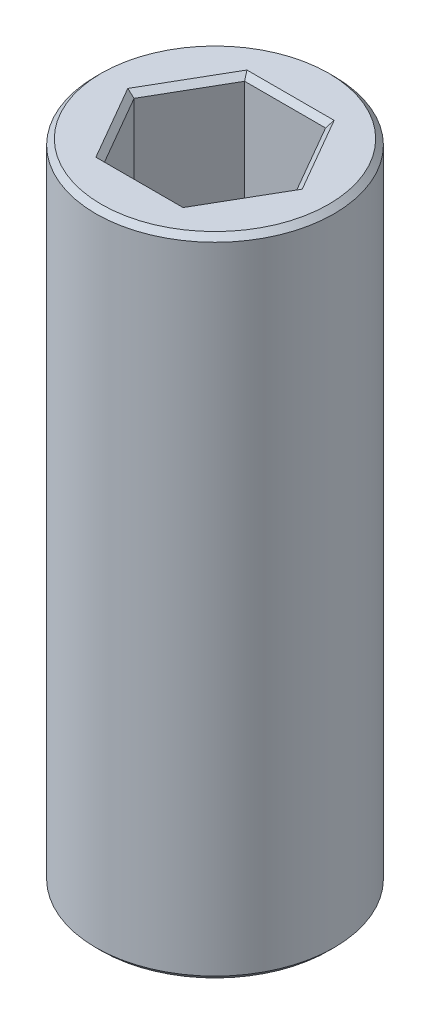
from build123d import *

# Parameters (mm, degrees)
SKETCH1_R           = 11.1125
BOSS_EXTRUDE1_DEPTH = 60.325
CHAMFER1_SIZE       = 0.508


with BuildPart() as part:
    # Sketch1 → Boss-Extrude1 (new body)
    with BuildSketch(Plane(origin=(0, 0, 0), x_dir=(1, 0, 0), z_dir=(0, 1, 0))):
        with Locations(Location((0, 0, 0), (0, 0, 90))):
            Circle(SKETCH1_R)
        Polygon((7.552318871, 0), (3.776159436, 6.5405), (-3.776159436, 6.5405), (-7.552318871, 0), (-3.776159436, -6.5405), (3.776159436, -6.5405), align=None, mode=Mode.SUBTRACT)
    extrude(amount=BOSS_EXTRUDE1_DEPTH)

    # Chamfer1
    chamfer1_edges = [part.edges().sort_by_distance(p)[0] for p in [
        (0, 0, -6.5405),
        (-5.664239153, 0, -3.27025),
        (-5.664239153, 0, 3.27025),
        (0, 0, 6.5405),
        (5.664239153, 60.325, 3.27025),
        (5.664239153, 60.325, -3.27025),
        (0, 60.325, -6.5405),
        (-5.664239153, 60.325, -3.27025),
        (-5.664239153, 60.325, 3.27025),
        (0, 60.325, 6.5405),
        (0, 0, 11.1125),
        (0, 60.325, 11.1125),
        (5.664239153, 0, 3.27025),
        (5.664239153, 0, -3.27025),
    ]]
    chamfer(chamfer1_edges, length=CHAMFER1_SIZE)


solid = part.part
